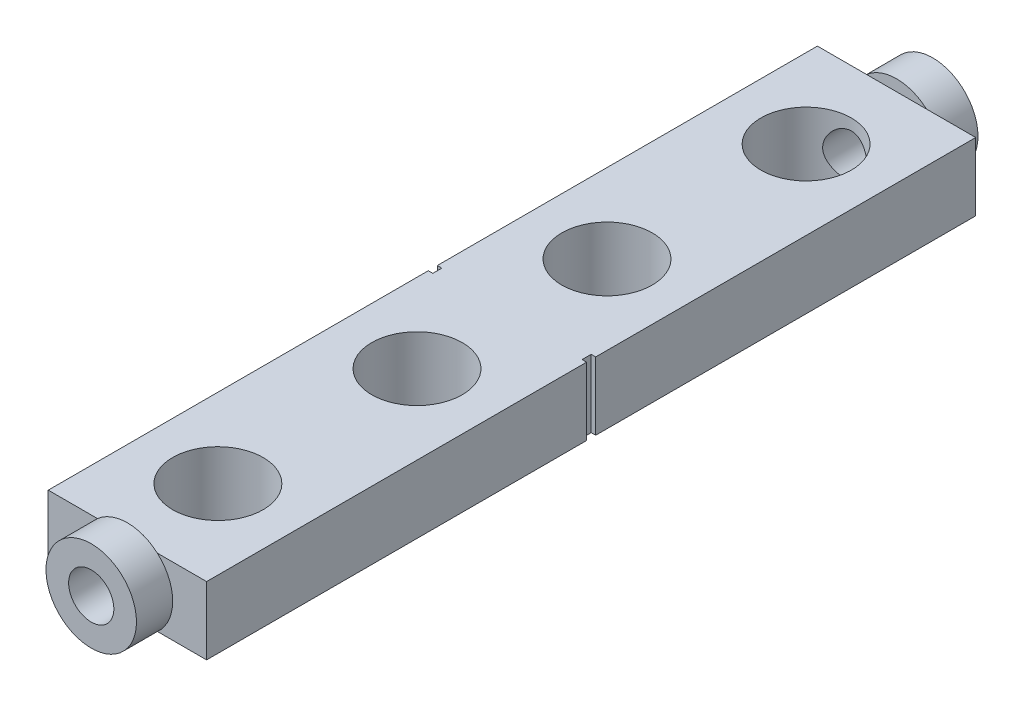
ISO-10303-21;
HEADER;
FILE_DESCRIPTION(('STEP AP214'),'2;1');
FILE_NAME('part.step','',(''),(''),'','','');
FILE_SCHEMA(('AUTOMOTIVE_DESIGN { 1 0 10303 214 1 1 1 1 }'));
ENDSEC;
DATA;
#1=APPLICATION_CONTEXT('core data for automotive mechanical design processes');
#2=APPLICATION_PROTOCOL_DEFINITION('international standard','automotive_design',2000,#1);
#3=PRODUCT_CONTEXT('',#1,'mechanical');
#4=PRODUCT('Part','Part','',(#3));
#5=PRODUCT_RELATED_PRODUCT_CATEGORY('part','',(#4));
#6=PRODUCT_DEFINITION_FORMATION('','',#4);
#7=PRODUCT_DEFINITION_CONTEXT('part definition',#1,'design');
#8=PRODUCT_DEFINITION('design','',#6,#7);
#9=PRODUCT_DEFINITION_SHAPE('','',#8);
#10=(LENGTH_UNIT() NAMED_UNIT(*) SI_UNIT(.MILLI.,.METRE.));
#11=(NAMED_UNIT(*) PLANE_ANGLE_UNIT() SI_UNIT($,.RADIAN.));
#12=(NAMED_UNIT(*) SI_UNIT($,.STERADIAN.) SOLID_ANGLE_UNIT());
#13=UNCERTAINTY_MEASURE_WITH_UNIT(LENGTH_MEASURE(1.E-05),#10,'distance_accuracy_value','');
#14=(GEOMETRIC_REPRESENTATION_CONTEXT(3) GLOBAL_UNCERTAINTY_ASSIGNED_CONTEXT((#13)) GLOBAL_UNIT_ASSIGNED_CONTEXT((#10,
#11,#12)) REPRESENTATION_CONTEXT('',''));
#15=CARTESIAN_POINT('',(0.,0.,0.));
#16=DIRECTION('',(0.,0.,1.));
#17=DIRECTION('',(1.,0.,0.));
#18=AXIS2_PLACEMENT_3D('',#15,#16,#17);
#19=CARTESIAN_POINT('',(1.75,0.75,8.50000000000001));
#20=DIRECTION('',(0.,0.,-1.));
#21=DIRECTION('',(-1.,0.,0.));
#22=AXIS2_PLACEMENT_3D('',#19,#20,#21);
#23=PLANE('',#22);
#24=CARTESIAN_POINT('',(0.,0.,8.50000000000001));
#25=DIRECTION('',(0.,0.,1.));
#26=DIRECTION('',(1.,0.,0.));
#27=AXIS2_PLACEMENT_3D('',#24,#25,#26);
#28=CIRCLE('',#27,1.);
#29=CARTESIAN_POINT('',(-0.661437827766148,0.75,8.50000000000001));
#30=VERTEX_POINT('',#29);
#31=CARTESIAN_POINT('',(-0.661437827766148,-0.75,8.50000000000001));
#32=VERTEX_POINT('',#31);
#33=EDGE_CURVE('E11',#30,#32,#28,.T.);
#34=ORIENTED_EDGE('',*,*,#33,.F.);
#35=DIRECTION('',(1.,0.,0.));
#36=VECTOR('',#35,1.);
#37=CARTESIAN_POINT('',(1.75,0.75,8.50000000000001));
#38=LINE('',#37,#36);
#39=CARTESIAN_POINT('',(-1.75,0.75,8.50000000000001));
#40=VERTEX_POINT('',#39);
#41=EDGE_CURVE('E347',#40,#30,#38,.T.);
#42=ORIENTED_EDGE('',*,*,#41,.F.);
#43=DIRECTION('',(0.,-1.,0.));
#44=VECTOR('',#43,1.);
#45=CARTESIAN_POINT('',(-1.75,0.75,8.50000000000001));
#46=LINE('',#45,#44);
#47=CARTESIAN_POINT('',(-1.75,-0.75,8.50000000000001));
#48=VERTEX_POINT('',#47);
#49=EDGE_CURVE('E319',#40,#48,#46,.T.);
#50=ORIENTED_EDGE('',*,*,#49,.T.);
#51=DIRECTION('',(1.,0.,0.));
#52=VECTOR('',#51,1.);
#53=CARTESIAN_POINT('',(1.75,-0.75,8.50000000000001));
#54=LINE('',#53,#52);
#55=EDGE_CURVE('E322',#48,#32,#54,.T.);
#56=ORIENTED_EDGE('',*,*,#55,.T.);
#57=EDGE_LOOP('',(#34,#42,#50,#56));
#58=FACE_BOUND('',#57,.T.);
#59=ADVANCED_FACE('F31',(#58),#23,.F.);
#60=CARTESIAN_POINT('',(0.661437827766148,-0.75,8.50000000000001));
#61=VERTEX_POINT('',#60);
#62=CARTESIAN_POINT('',(0.661437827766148,0.75,8.50000000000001));
#63=VERTEX_POINT('',#62);
#64=EDGE_CURVE('E40',#61,#63,#28,.T.);
#65=ORIENTED_EDGE('',*,*,#64,.F.);
#66=CARTESIAN_POINT('',(1.75,-0.75,8.50000000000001));
#67=VERTEX_POINT('',#66);
#68=EDGE_CURVE('E323',#61,#67,#54,.T.);
#69=ORIENTED_EDGE('',*,*,#68,.T.);
#70=DIRECTION('',(0.,-1.,0.));
#71=VECTOR('',#70,1.);
#72=CARTESIAN_POINT('',(1.75,0.75,8.50000000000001));
#73=LINE('',#72,#71);
#74=CARTESIAN_POINT('',(1.75,0.75,8.50000000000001));
#75=VERTEX_POINT('',#74);
#76=EDGE_CURVE('E343',#75,#67,#73,.T.);
#77=ORIENTED_EDGE('',*,*,#76,.F.);
#78=EDGE_CURVE('E352',#63,#75,#38,.T.);
#79=ORIENTED_EDGE('',*,*,#78,.F.);
#80=EDGE_LOOP('',(#65,#69,#77,#79));
#81=FACE_BOUND('',#80,.T.);
#82=ADVANCED_FACE('F275',(#81),#23,.F.);
#83=CARTESIAN_POINT('',(-1.65,0.75,0.));
#84=DIRECTION('',(0.,-1.,0.));
#85=DIRECTION('',(0.,0.,-1.));
#86=AXIS2_PLACEMENT_3D('',#83,#84,#85);
#87=PLANE('',#86);
#88=CARTESIAN_POINT('',(0.,0.75,6.5));
#89=DIRECTION('',(0.,1.,0.));
#90=DIRECTION('',(0.,0.,1.));
#91=AXIS2_PLACEMENT_3D('',#88,#89,#90);
#92=CIRCLE('',#91,1.);
#93=CARTESIAN_POINT('',(0.,0.75,7.5));
#94=VERTEX_POINT('',#93);
#95=EDGE_CURVE('E364',#94,#94,#92,.T.);
#96=ORIENTED_EDGE('',*,*,#95,.F.);
#97=EDGE_LOOP('',(#96));
#98=FACE_BOUND('',#97,.T.);
#99=DIRECTION('',(0.,0.,1.));
#100=VECTOR('',#99,1.);
#101=CARTESIAN_POINT('',(-1.65,0.75,0.1));
#102=LINE('',#101,#100);
#103=CARTESIAN_POINT('',(-1.65,0.75,-0.0999999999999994));
#104=VERTEX_POINT('',#103);
#105=CARTESIAN_POINT('',(-1.65,0.75,0.1));
#106=VERTEX_POINT('',#105);
#107=EDGE_CURVE('E335',#104,#106,#102,.T.);
#108=ORIENTED_EDGE('',*,*,#107,.T.);
#109=DIRECTION('',(-1.,0.,0.));
#110=VECTOR('',#109,1.);
#111=CARTESIAN_POINT('',(-1.75,0.75,0.0999999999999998));
#112=LINE('',#111,#110);
#113=CARTESIAN_POINT('',(-1.75,0.75,0.0999999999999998));
#114=VERTEX_POINT('',#113);
#115=EDGE_CURVE('E357',#106,#114,#112,.T.);
#116=ORIENTED_EDGE('',*,*,#115,.T.);
#117=DIRECTION('',(0.,0.,1.));
#118=VECTOR('',#117,1.);
#119=CARTESIAN_POINT('',(-1.75,0.75,8.50000000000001));
#120=LINE('',#119,#118);
#121=EDGE_CURVE('E318',#114,#40,#120,.T.);
#122=ORIENTED_EDGE('',*,*,#121,.T.);
#123=ORIENTED_EDGE('',*,*,#41,.T.);
#124=EDGE_CURVE('E350',#30,#63,#38,.T.);
#125=ORIENTED_EDGE('',*,*,#124,.T.);
#126=ORIENTED_EDGE('',*,*,#78,.T.);
#127=DIRECTION('',(0.,0.,-1.));
#128=VECTOR('',#127,1.);
#129=CARTESIAN_POINT('',(1.75,0.75,0.0999999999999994));
#130=LINE('',#129,#128);
#131=CARTESIAN_POINT('',(1.75,0.75,0.0999999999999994));
#132=VERTEX_POINT('',#131);
#133=EDGE_CURVE('E349',#75,#132,#130,.T.);
#134=ORIENTED_EDGE('',*,*,#133,.T.);
#135=DIRECTION('',(-1.,0.,0.));
#136=VECTOR('',#135,1.);
#137=CARTESIAN_POINT('',(1.65,0.75,0.0999999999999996));
#138=LINE('',#137,#136);
#139=CARTESIAN_POINT('',(1.65,0.75,0.0999999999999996));
#140=VERTEX_POINT('',#139);
#141=EDGE_CURVE('E353',#132,#140,#138,.T.);
#142=ORIENTED_EDGE('',*,*,#141,.T.);
#143=DIRECTION('',(0.,0.,-1.));
#144=VECTOR('',#143,1.);
#145=CARTESIAN_POINT('',(1.65,0.75,0.));
#146=LINE('',#145,#144);
#147=CARTESIAN_POINT('',(1.65,0.75,-0.1));
#148=VERTEX_POINT('',#147);
#149=EDGE_CURVE('E340',#140,#148,#146,.T.);
#150=ORIENTED_EDGE('',*,*,#149,.T.);
#151=DIRECTION('',(-1.,0.,0.));
#152=VECTOR('',#151,1.);
#153=CARTESIAN_POINT('',(1.65,0.75,-0.1));
#154=LINE('',#153,#152);
#155=CARTESIAN_POINT('',(1.75,0.75,-0.1));
#156=VERTEX_POINT('',#155);
#157=EDGE_CURVE('E210',#156,#148,#154,.T.);
#158=ORIENTED_EDGE('',*,*,#157,.F.);
#159=DIRECTION('',(0.,0.,1.));
#160=VECTOR('',#159,1.);
#161=CARTESIAN_POINT('',(1.75,0.75,-0.1));
#162=LINE('',#161,#160);
#163=CARTESIAN_POINT('',(1.75,0.75,-8.50000000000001));
#164=VERTEX_POINT('',#163);
#165=EDGE_CURVE('E174',#164,#156,#162,.T.);
#166=ORIENTED_EDGE('',*,*,#165,.F.);
#167=DIRECTION('',(1.,0.,0.));
#168=VECTOR('',#167,1.);
#169=CARTESIAN_POINT('',(1.75,0.75,-8.50000000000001));
#170=LINE('',#169,#168);
#171=CARTESIAN_POINT('',(0.661437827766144,0.75,-8.50000000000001));
#172=VERTEX_POINT('',#171);
#173=EDGE_CURVE('E166',#172,#164,#170,.T.);
#174=ORIENTED_EDGE('',*,*,#173,.F.);
#175=CARTESIAN_POINT('',(-0.661437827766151,0.75,-8.50000000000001));
#176=VERTEX_POINT('',#175);
#177=EDGE_CURVE('E159',#176,#172,#170,.T.);
#178=ORIENTED_EDGE('',*,*,#177,.F.);
#179=CARTESIAN_POINT('',(-1.75,0.75,-8.50000000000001));
#180=VERTEX_POINT('',#179);
#181=EDGE_CURVE('E165',#180,#176,#170,.T.);
#182=ORIENTED_EDGE('',*,*,#181,.F.);
#183=DIRECTION('',(0.,0.,-1.));
#184=VECTOR('',#183,1.);
#185=CARTESIAN_POINT('',(-1.75,0.75,-8.50000000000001));
#186=LINE('',#185,#184);
#187=CARTESIAN_POINT('',(-1.75,0.75,-0.0999999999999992));
#188=VERTEX_POINT('',#187);
#189=EDGE_CURVE('E178',#188,#180,#186,.T.);
#190=ORIENTED_EDGE('',*,*,#189,.F.);
#191=DIRECTION('',(-1.,0.,0.));
#192=VECTOR('',#191,1.);
#193=CARTESIAN_POINT('',(-1.75,0.75,-0.0999999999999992));
#194=LINE('',#193,#192);
#195=EDGE_CURVE('E204',#104,#188,#194,.T.);
#196=ORIENTED_EDGE('',*,*,#195,.F.);
#197=EDGE_LOOP('',(#108,#116,#122,#123,#125,#126,#134,#142,#150,#158,#166,#174,#178,#182,#190,#196));
#198=FACE_BOUND('',#197,.T.);
#199=CARTESIAN_POINT('',(0.,0.75,2.1));
#200=DIRECTION('',(0.,1.,0.));
#201=DIRECTION('',(0.,0.,-1.));
#202=AXIS2_PLACEMENT_3D('',#199,#200,#201);
#203=CIRCLE('',#202,1.);
#204=CARTESIAN_POINT('',(0.,0.75,1.1));
#205=VERTEX_POINT('',#204);
#206=EDGE_CURVE('E365',#205,#205,#203,.T.);
#207=ORIENTED_EDGE('',*,*,#206,.F.);
#208=EDGE_LOOP('',(#207));
#209=FACE_BOUND('',#208,.T.);
#210=CARTESIAN_POINT('',(0.,0.75,-6.5));
#211=DIRECTION('',(0.,-1.,0.));
#212=DIRECTION('',(0.,0.,-1.));
#213=AXIS2_PLACEMENT_3D('',#210,#211,#212);
#214=CIRCLE('',#213,1.);
#215=CARTESIAN_POINT('',(0.,0.75,-7.5));
#216=VERTEX_POINT('',#215);
#217=EDGE_CURVE('E198',#216,#216,#214,.T.);
#218=ORIENTED_EDGE('',*,*,#217,.T.);
#219=EDGE_LOOP('',(#218));
#220=FACE_BOUND('',#219,.T.);
#221=CARTESIAN_POINT('',(0.,0.75,-2.1));
#222=DIRECTION('',(0.,-1.,0.));
#223=DIRECTION('',(0.,0.,1.));
#224=AXIS2_PLACEMENT_3D('',#221,#222,#223);
#225=CIRCLE('',#224,1.);
#226=CARTESIAN_POINT('',(0.,0.75,-1.1));
#227=VERTEX_POINT('',#226);
#228=EDGE_CURVE('E191',#227,#227,#225,.T.);
#229=ORIENTED_EDGE('',*,*,#228,.T.);
#230=EDGE_LOOP('',(#229));
#231=FACE_BOUND('',#230,.T.);
#232=ADVANCED_FACE('F170',(#98,#198,#209,#220,#231),#87,.F.);
#233=CARTESIAN_POINT('',(-1.65,-0.75,0.));
#234=DIRECTION('',(0.,-1.,0.));
#235=DIRECTION('',(0.,0.,-1.));
#236=AXIS2_PLACEMENT_3D('',#233,#234,#235);
#237=PLANE('',#236);
#238=CARTESIAN_POINT('',(0.,-0.75,6.5));
#239=DIRECTION('',(0.,1.,0.));
#240=DIRECTION('',(0.,0.,1.));
#241=AXIS2_PLACEMENT_3D('',#238,#239,#240);
#242=CIRCLE('',#241,1.);
#243=CARTESIAN_POINT('',(0.,-0.75,7.5));
#244=VERTEX_POINT('',#243);
#245=EDGE_CURVE('E361',#244,#244,#242,.T.);
#246=ORIENTED_EDGE('',*,*,#245,.T.);
#247=EDGE_LOOP('',(#246));
#248=FACE_BOUND('',#247,.T.);
#249=DIRECTION('',(0.,0.,1.));
#250=VECTOR('',#249,1.);
#251=CARTESIAN_POINT('',(-1.65,-0.75,0.1));
#252=LINE('',#251,#250);
#253=CARTESIAN_POINT('',(-1.65,-0.75,-0.0999999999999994));
#254=VERTEX_POINT('',#253);
#255=CARTESIAN_POINT('',(-1.65,-0.75,0.1));
#256=VERTEX_POINT('',#255);
#257=EDGE_CURVE('E314',#254,#256,#252,.T.);
#258=ORIENTED_EDGE('',*,*,#257,.F.);
#259=DIRECTION('',(-1.,0.,0.));
#260=VECTOR('',#259,1.);
#261=CARTESIAN_POINT('',(-1.75,-0.75,-0.0999999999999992));
#262=LINE('',#261,#260);
#263=CARTESIAN_POINT('',(-1.75,-0.75,-0.0999999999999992));
#264=VERTEX_POINT('',#263);
#265=EDGE_CURVE('E201',#254,#264,#262,.T.);
#266=ORIENTED_EDGE('',*,*,#265,.T.);
#267=DIRECTION('',(0.,0.,-1.));
#268=VECTOR('',#267,1.);
#269=CARTESIAN_POINT('',(-1.75,-0.75,-8.50000000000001));
#270=LINE('',#269,#268);
#271=CARTESIAN_POINT('',(-1.75,-0.75,-8.50000000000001));
#272=VERTEX_POINT('',#271);
#273=EDGE_CURVE('E216',#264,#272,#270,.T.);
#274=ORIENTED_EDGE('',*,*,#273,.T.);
#275=DIRECTION('',(1.,0.,0.));
#276=VECTOR('',#275,1.);
#277=CARTESIAN_POINT('',(1.75,-0.75,-8.50000000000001));
#278=LINE('',#277,#276);
#279=CARTESIAN_POINT('',(-0.661437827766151,-0.75,-8.50000000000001));
#280=VERTEX_POINT('',#279);
#281=EDGE_CURVE('E218',#272,#280,#278,.T.);
#282=ORIENTED_EDGE('',*,*,#281,.T.);
#283=CARTESIAN_POINT('',(0.661437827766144,-0.75,-8.50000000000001));
#284=VERTEX_POINT('',#283);
#285=EDGE_CURVE('E222',#280,#284,#278,.T.);
#286=ORIENTED_EDGE('',*,*,#285,.T.);
#287=CARTESIAN_POINT('',(1.75,-0.75,-8.50000000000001));
#288=VERTEX_POINT('',#287);
#289=EDGE_CURVE('E182',#284,#288,#278,.T.);
#290=ORIENTED_EDGE('',*,*,#289,.T.);
#291=DIRECTION('',(0.,0.,1.));
#292=VECTOR('',#291,1.);
#293=CARTESIAN_POINT('',(1.75,-0.75,-0.1));
#294=LINE('',#293,#292);
#295=CARTESIAN_POINT('',(1.75,-0.75,-0.1));
#296=VERTEX_POINT('',#295);
#297=EDGE_CURVE('E221',#288,#296,#294,.T.);
#298=ORIENTED_EDGE('',*,*,#297,.T.);
#299=DIRECTION('',(-1.,0.,0.));
#300=VECTOR('',#299,1.);
#301=CARTESIAN_POINT('',(1.65,-0.75,-0.1));
#302=LINE('',#301,#300);
#303=CARTESIAN_POINT('',(1.65,-0.75,-0.1));
#304=VERTEX_POINT('',#303);
#305=EDGE_CURVE('E207',#296,#304,#302,.T.);
#306=ORIENTED_EDGE('',*,*,#305,.T.);
#307=DIRECTION('',(0.,0.,-1.));
#308=VECTOR('',#307,1.);
#309=CARTESIAN_POINT('',(1.65,-0.75,0.));
#310=LINE('',#309,#308);
#311=CARTESIAN_POINT('',(1.65,-0.75,0.0999999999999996));
#312=VERTEX_POINT('',#311);
#313=EDGE_CURVE('E333',#312,#304,#310,.T.);
#314=ORIENTED_EDGE('',*,*,#313,.F.);
#315=DIRECTION('',(-1.,0.,0.));
#316=VECTOR('',#315,1.);
#317=CARTESIAN_POINT('',(1.65,-0.75,0.0999999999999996));
#318=LINE('',#317,#316);
#319=CARTESIAN_POINT('',(1.75,-0.75,0.0999999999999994));
#320=VERTEX_POINT('',#319);
#321=EDGE_CURVE('E331',#320,#312,#318,.T.);
#322=ORIENTED_EDGE('',*,*,#321,.F.);
#323=DIRECTION('',(0.,0.,-1.));
#324=VECTOR('',#323,1.);
#325=CARTESIAN_POINT('',(1.75,-0.75,0.0999999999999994));
#326=LINE('',#325,#324);
#327=EDGE_CURVE('E329',#67,#320,#326,.T.);
#328=ORIENTED_EDGE('',*,*,#327,.F.);
#329=ORIENTED_EDGE('',*,*,#68,.F.);
#330=EDGE_CURVE('E325',#32,#61,#54,.T.);
#331=ORIENTED_EDGE('',*,*,#330,.F.);
#332=ORIENTED_EDGE('',*,*,#55,.F.);
#333=DIRECTION('',(0.,0.,1.));
#334=VECTOR('',#333,1.);
#335=CARTESIAN_POINT('',(-1.75,-0.75,8.50000000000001));
#336=LINE('',#335,#334);
#337=CARTESIAN_POINT('',(-1.75,-0.75,0.0999999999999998));
#338=VERTEX_POINT('',#337);
#339=EDGE_CURVE('E313',#338,#48,#336,.T.);
#340=ORIENTED_EDGE('',*,*,#339,.F.);
#341=DIRECTION('',(-1.,0.,0.));
#342=VECTOR('',#341,1.);
#343=CARTESIAN_POINT('',(-1.75,-0.75,0.0999999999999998));
#344=LINE('',#343,#342);
#345=EDGE_CURVE('E305',#256,#338,#344,.T.);
#346=ORIENTED_EDGE('',*,*,#345,.F.);
#347=EDGE_LOOP('',(#258,#266,#274,#282,#286,#290,#298,#306,#314,#322,#328,#329,#331,#332,#340,#346));
#348=FACE_BOUND('',#347,.T.);
#349=CARTESIAN_POINT('',(0.,-0.75,2.1));
#350=DIRECTION('',(0.,1.,0.));
#351=DIRECTION('',(0.,0.,-1.));
#352=AXIS2_PLACEMENT_3D('',#349,#350,#351);
#353=CIRCLE('',#352,1.);
#354=CARTESIAN_POINT('',(0.,-0.75,1.1));
#355=VERTEX_POINT('',#354);
#356=EDGE_CURVE('E368',#355,#355,#353,.T.);
#357=ORIENTED_EDGE('',*,*,#356,.T.);
#358=EDGE_LOOP('',(#357));
#359=FACE_BOUND('',#358,.T.);
#360=CARTESIAN_POINT('',(0.,-0.75,-6.5));
#361=DIRECTION('',(0.,-1.,0.));
#362=DIRECTION('',(0.,0.,-1.));
#363=AXIS2_PLACEMENT_3D('',#360,#361,#362);
#364=CIRCLE('',#363,1.);
#365=CARTESIAN_POINT('',(0.,-0.75,-7.5));
#366=VERTEX_POINT('',#365);
#367=EDGE_CURVE('E194',#366,#366,#364,.T.);
#368=ORIENTED_EDGE('',*,*,#367,.F.);
#369=EDGE_LOOP('',(#368));
#370=FACE_BOUND('',#369,.T.);
#371=CARTESIAN_POINT('',(0.,-0.75,-2.1));
#372=DIRECTION('',(0.,-1.,0.));
#373=DIRECTION('',(0.,0.,1.));
#374=AXIS2_PLACEMENT_3D('',#371,#372,#373);
#375=CIRCLE('',#374,1.);
#376=CARTESIAN_POINT('',(0.,-0.75,-1.1));
#377=VERTEX_POINT('',#376);
#378=EDGE_CURVE('E195',#377,#377,#375,.T.);
#379=ORIENTED_EDGE('',*,*,#378,.F.);
#380=EDGE_LOOP('',(#379));
#381=FACE_BOUND('',#380,.T.);
#382=ADVANCED_FACE('F274',(#248,#348,#359,#370,#381),#237,.T.);
#383=CARTESIAN_POINT('',(-1.65,0.75,0.1));
#384=DIRECTION('',(1.,0.,0.));
#385=DIRECTION('',(0.,0.,-1.));
#386=AXIS2_PLACEMENT_3D('',#383,#384,#385);
#387=PLANE('',#386);
#388=ORIENTED_EDGE('',*,*,#257,.T.);
#389=DIRECTION('',(0.,-1.,0.));
#390=VECTOR('',#389,1.);
#391=CARTESIAN_POINT('',(-1.65,0.75,0.1));
#392=LINE('',#391,#390);
#393=EDGE_CURVE('E35',#106,#256,#392,.T.);
#394=ORIENTED_EDGE('',*,*,#393,.F.);
#395=ORIENTED_EDGE('',*,*,#107,.F.);
#396=DIRECTION('',(0.,-1.,0.));
#397=VECTOR('',#396,1.);
#398=CARTESIAN_POINT('',(-1.65,0.75,-0.0999999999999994));
#399=LINE('',#398,#397);
#400=EDGE_CURVE('E183',#104,#254,#399,.T.);
#401=ORIENTED_EDGE('',*,*,#400,.T.);
#402=EDGE_LOOP('',(#388,#394,#395,#401));
#403=FACE_BOUND('',#402,.T.);
#404=ADVANCED_FACE('F33',(#403),#387,.F.);
#405=CARTESIAN_POINT('',(-1.75,0.75,0.0999999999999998));
#406=DIRECTION('',(0.,0.,1.));
#407=DIRECTION('',(1.,0.,0.));
#408=AXIS2_PLACEMENT_3D('',#405,#406,#407);
#409=PLANE('',#408);
#410=ORIENTED_EDGE('',*,*,#345,.T.);
#411=DIRECTION('',(0.,-1.,0.));
#412=VECTOR('',#411,1.);
#413=CARTESIAN_POINT('',(-1.75,0.75,0.0999999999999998));
#414=LINE('',#413,#412);
#415=EDGE_CURVE('E307',#114,#338,#414,.T.);
#416=ORIENTED_EDGE('',*,*,#415,.F.);
#417=ORIENTED_EDGE('',*,*,#115,.F.);
#418=ORIENTED_EDGE('',*,*,#393,.T.);
#419=EDGE_LOOP('',(#410,#416,#417,#418));
#420=FACE_BOUND('',#419,.T.);
#421=ADVANCED_FACE('F295',(#420),#409,.F.);
#422=CARTESIAN_POINT('',(-1.75,0.75,8.50000000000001));
#423=DIRECTION('',(1.,0.,0.));
#424=DIRECTION('',(0.,0.,-1.));
#425=AXIS2_PLACEMENT_3D('',#422,#423,#424);
#426=PLANE('',#425);
#427=ORIENTED_EDGE('',*,*,#339,.T.);
#428=ORIENTED_EDGE('',*,*,#49,.F.);
#429=ORIENTED_EDGE('',*,*,#121,.F.);
#430=ORIENTED_EDGE('',*,*,#415,.T.);
#431=EDGE_LOOP('',(#427,#428,#429,#430));
#432=FACE_BOUND('',#431,.T.);
#433=ADVANCED_FACE('F290',(#432),#426,.F.);
#434=CARTESIAN_POINT('',(1.75,0.75,0.0999999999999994));
#435=DIRECTION('',(-1.,0.,0.));
#436=DIRECTION('',(0.,0.,1.));
#437=AXIS2_PLACEMENT_3D('',#434,#435,#436);
#438=PLANE('',#437);
#439=ORIENTED_EDGE('',*,*,#327,.T.);
#440=DIRECTION('',(0.,-1.,0.));
#441=VECTOR('',#440,1.);
#442=CARTESIAN_POINT('',(1.75,0.75,0.0999999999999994));
#443=LINE('',#442,#441);
#444=EDGE_CURVE('E339',#132,#320,#443,.T.);
#445=ORIENTED_EDGE('',*,*,#444,.F.);
#446=ORIENTED_EDGE('',*,*,#133,.F.);
#447=ORIENTED_EDGE('',*,*,#76,.T.);
#448=EDGE_LOOP('',(#439,#445,#446,#447));
#449=FACE_BOUND('',#448,.T.);
#450=ADVANCED_FACE('F286',(#449),#438,.F.);
#451=CARTESIAN_POINT('',(1.65,0.75,0.0999999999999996));
#452=DIRECTION('',(0.,0.,1.));
#453=DIRECTION('',(1.,0.,0.));
#454=AXIS2_PLACEMENT_3D('',#451,#452,#453);
#455=PLANE('',#454);
#456=ORIENTED_EDGE('',*,*,#321,.T.);
#457=DIRECTION('',(0.,-1.,0.));
#458=VECTOR('',#457,1.);
#459=CARTESIAN_POINT('',(1.65,0.75,0.0999999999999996));
#460=LINE('',#459,#458);
#461=EDGE_CURVE('E336',#140,#312,#460,.T.);
#462=ORIENTED_EDGE('',*,*,#461,.F.);
#463=ORIENTED_EDGE('',*,*,#141,.F.);
#464=ORIENTED_EDGE('',*,*,#444,.T.);
#465=EDGE_LOOP('',(#456,#462,#463,#464));
#466=FACE_BOUND('',#465,.T.);
#467=ADVANCED_FACE('F282',(#466),#455,.F.);
#468=CARTESIAN_POINT('',(1.65,0.75,0.));
#469=DIRECTION('',(-1.,0.,0.));
#470=DIRECTION('',(0.,0.,1.));
#471=AXIS2_PLACEMENT_3D('',#468,#469,#470);
#472=PLANE('',#471);
#473=ORIENTED_EDGE('',*,*,#313,.T.);
#474=DIRECTION('',(0.,-1.,0.));
#475=VECTOR('',#474,1.);
#476=CARTESIAN_POINT('',(1.65,0.75,-0.1));
#477=LINE('',#476,#475);
#478=EDGE_CURVE('E213',#148,#304,#477,.T.);
#479=ORIENTED_EDGE('',*,*,#478,.F.);
#480=ORIENTED_EDGE('',*,*,#149,.F.);
#481=ORIENTED_EDGE('',*,*,#461,.T.);
#482=EDGE_LOOP('',(#473,#479,#480,#481));
#483=FACE_BOUND('',#482,.T.);
#484=ADVANCED_FACE('F270',(#483),#472,.F.);
#485=CARTESIAN_POINT('',(0.,0.75,6.5));
#486=DIRECTION('',(0.,-1.,0.));
#487=DIRECTION('',(0.,0.,-1.));
#488=AXIS2_PLACEMENT_3D('',#485,#486,#487);
#489=CYLINDRICAL_SURFACE('',#488,1.);
#490=CARTESIAN_POINT('',(0.5,0.,7.36602540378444));
#491=CARTESIAN_POINT('',(0.499998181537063,0.0260539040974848,7.36602767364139));
#492=CARTESIAN_POINT('',(0.497949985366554,0.0521407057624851,7.36721900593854));
#493=CARTESIAN_POINT('',(0.489861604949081,0.103513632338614,7.37181183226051));
#494=CARTESIAN_POINT('',(0.483813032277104,0.128797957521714,7.37521797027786));
#495=CARTESIAN_POINT('',(0.468049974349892,0.177725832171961,7.38374673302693));
#496=CARTESIAN_POINT('',(0.458354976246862,0.201377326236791,7.38886021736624));
#497=CARTESIAN_POINT('',(0.43563376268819,0.246712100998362,7.40021332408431));
#498=CARTESIAN_POINT('',(0.422607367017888,0.268395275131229,7.40645300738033));
#499=CARTESIAN_POINT('',(0.392333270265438,0.311152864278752,7.4199843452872));
#500=CARTESIAN_POINT('',(0.374826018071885,0.332029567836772,7.42732031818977));
#501=CARTESIAN_POINT('',(0.336626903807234,0.370704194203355,7.44185991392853));
#502=CARTESIAN_POINT('',(0.315933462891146,0.388500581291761,7.44906346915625));
#503=CARTESIAN_POINT('',(0.270244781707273,0.421683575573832,7.46310738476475));
#504=CARTESIAN_POINT('',(0.245053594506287,0.436826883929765,7.46989053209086));
#505=CARTESIAN_POINT('',(0.192078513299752,0.462570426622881,7.48175378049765));
#506=CARTESIAN_POINT('',(0.164296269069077,0.473173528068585,7.48683495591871));
#507=CARTESIAN_POINT('',(0.109022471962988,0.488752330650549,7.49440230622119));
#508=CARTESIAN_POINT('',(0.0816508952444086,0.494074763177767,7.49704740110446));
#509=CARTESIAN_POINT('',(0.026285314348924,0.500083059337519,7.50003791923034));
#510=CARTESIAN_POINT('',(-0.00170830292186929,0.500771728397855,7.50038473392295));
#511=CARTESIAN_POINT('',(-0.054916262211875,0.497626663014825,7.49881490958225));
#512=CARTESIAN_POINT('',(-0.0801605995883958,0.494180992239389,7.4970924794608));
#513=CARTESIAN_POINT('',(-0.129656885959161,0.483559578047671,7.49187122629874));
#514=CARTESIAN_POINT('',(-0.153908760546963,0.476383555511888,7.48837227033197));
#515=CARTESIAN_POINT('',(-0.201154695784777,0.458458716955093,7.47985791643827));
#516=CARTESIAN_POINT('',(-0.224126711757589,0.447661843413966,7.474822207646));
#517=CARTESIAN_POINT('',(-0.267988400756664,0.422868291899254,7.46368822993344));
#518=CARTESIAN_POINT('',(-0.288877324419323,0.408870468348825,7.45758958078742));
#519=CARTESIAN_POINT('',(-0.330086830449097,0.376552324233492,7.44422197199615));
#520=CARTESIAN_POINT('',(-0.35016703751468,0.357948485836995,7.43689687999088));
#521=CARTESIAN_POINT('',(-0.38705218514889,0.317705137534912,7.42227170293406));
#522=CARTESIAN_POINT('',(-0.403854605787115,0.296063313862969,7.41497164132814));
#523=CARTESIAN_POINT('',(-0.434752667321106,0.248675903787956,7.40072078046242));
#524=CARTESIAN_POINT('',(-0.448608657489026,0.222756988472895,7.39382159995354));
#525=CARTESIAN_POINT('',(-0.471659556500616,0.168531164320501,7.38187725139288));
#526=CARTESIAN_POINT('',(-0.480859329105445,0.140226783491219,7.37683015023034));
#527=CARTESIAN_POINT('',(-0.49359010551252,0.0843927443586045,7.36972317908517));
#528=CARTESIAN_POINT('',(-0.497512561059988,0.0569794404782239,7.36745827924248));
#529=CARTESIAN_POINT('',(-0.500758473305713,0.00179932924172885,7.36558959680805));
#530=CARTESIAN_POINT('',(-0.500085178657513,-0.0259672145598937,7.36598393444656));
#531=CARTESIAN_POINT('',(-0.494518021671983,-0.0778269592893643,7.36917168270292));
#532=CARTESIAN_POINT('',(-0.490093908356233,-0.101989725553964,7.37169793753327));
#533=CARTESIAN_POINT('',(-0.477848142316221,-0.149183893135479,7.3784701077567));
#534=CARTESIAN_POINT('',(-0.470025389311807,-0.172214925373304,7.38271658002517));
#535=CARTESIAN_POINT('',(-0.450823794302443,-0.217705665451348,7.39268111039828));
#536=CARTESIAN_POINT('',(-0.439297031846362,-0.240089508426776,7.39845821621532));
#537=CARTESIAN_POINT('',(-0.413143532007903,-0.282734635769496,7.41078059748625));
#538=CARTESIAN_POINT('',(-0.398515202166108,-0.302994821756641,7.41732626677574));
#539=CARTESIAN_POINT('',(-0.364418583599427,-0.343489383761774,7.43143999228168));
#540=CARTESIAN_POINT('',(-0.344572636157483,-0.363398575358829,7.43903291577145));
#541=CARTESIAN_POINT('',(-0.301702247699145,-0.399706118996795,7.45367117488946));
#542=CARTESIAN_POINT('',(-0.278676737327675,-0.416103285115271,7.46071632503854));
#543=CARTESIAN_POINT('',(-0.229267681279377,-0.44528686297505,7.47370680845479));
#544=CARTESIAN_POINT('',(-0.202811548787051,-0.457966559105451,7.47961820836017));
#545=CARTESIAN_POINT('',(-0.147761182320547,-0.4785689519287,7.48941677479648));
#546=CARTESIAN_POINT('',(-0.11916885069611,-0.486495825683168,7.49330571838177));
#547=CARTESIAN_POINT('',(-0.0634898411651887,-0.496684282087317,7.4983375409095));
#548=CARTESIAN_POINT('',(-0.0365057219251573,-0.499398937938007,7.49969963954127));
#549=CARTESIAN_POINT('',(0.0175629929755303,-0.50042163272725,7.50021065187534));
#550=CARTESIAN_POINT('',(0.0446475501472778,-0.498731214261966,7.49936034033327));
#551=CARTESIAN_POINT('',(0.0962689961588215,-0.491291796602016,7.49566984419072));
#552=CARTESIAN_POINT('',(0.120856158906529,-0.485817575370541,7.49296447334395));
#553=CARTESIAN_POINT('',(0.168722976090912,-0.471336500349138,7.48596046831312));
#554=CARTESIAN_POINT('',(0.192002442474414,-0.462329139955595,7.48166160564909));
#555=CARTESIAN_POINT('',(0.237711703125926,-0.440636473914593,7.47162965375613));
#556=CARTESIAN_POINT('',(0.260062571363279,-0.427810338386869,7.4658430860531));
#557=CARTESIAN_POINT('',(0.30238732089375,-0.39902103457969,7.45344066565));
#558=CARTESIAN_POINT('',(0.322360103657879,-0.383056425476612,7.44682443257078));
#559=CARTESIAN_POINT('',(0.361457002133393,-0.346601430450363,7.43264305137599));
#560=CARTESIAN_POINT('',(0.380298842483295,-0.325818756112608,7.42504899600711));
#561=CARTESIAN_POINT('',(0.414331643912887,-0.281274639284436,7.41031538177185));
#562=CARTESIAN_POINT('',(0.429519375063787,-0.257510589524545,7.40317622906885));
#563=CARTESIAN_POINT('',(0.456215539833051,-0.206681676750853,7.38999802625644));
#564=CARTESIAN_POINT('',(0.467592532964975,-0.179536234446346,7.38400087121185));
#565=CARTESIAN_POINT('',(0.485439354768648,-0.123333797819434,7.37433078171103));
#566=CARTESIAN_POINT('',(0.491925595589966,-0.0942835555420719,7.37065008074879));
#567=CARTESIAN_POINT('',(0.497183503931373,-0.0540973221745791,7.36764636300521));
#568=CARTESIAN_POINT('',(0.498238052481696,-0.0433160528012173,7.36704064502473));
#569=CARTESIAN_POINT('',(0.499646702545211,-0.0216917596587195,7.36622967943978));
#570=CARTESIAN_POINT('',(0.50000075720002,-0.0108487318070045,7.36602445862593));
#571=CARTESIAN_POINT('',(0.5,0.,7.36602540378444));
#572=B_SPLINE_CURVE_WITH_KNOTS('',3,(#490,#491,#492,#493,#494,#495,#496,#497,#498,#499,#500,
#501,#502,#503,#504,#505,#506,#507,#508,#509,#510,#511,#512,#513,#514,#515,#516,#517,#518,#519,
#520,#521,#522,#523,#524,#525,#526,#527,#528,#529,#530,#531,#532,#533,#534,#535,#536,#537,#538,
#539,#540,#541,#542,#543,#544,#545,#546,#547,#548,#549,#550,#551,#552,#553,#554,#555,#556,#557,
#558,#559,#560,#561,#562,#563,#564,#565,#566,#567,#568,#569,#570,#571),.UNSPECIFIED.,.T.,.F.,(4,
2,2,2,2,2,2,2,2,2,2,2,2,2,2,2,2,2,2,2,2,2,2,2,2,2,2,2,2,2,2,2,2,2,2,2,2,2,2,2,4),(0.,
0.0781160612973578,0.156396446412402,0.234264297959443,0.312136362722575,0.396431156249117,
0.480767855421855,0.570789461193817,0.660754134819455,0.744317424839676,0.8278301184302,
0.904080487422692,0.980336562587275,1.05764767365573,1.13498649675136,1.21963595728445,
1.30435024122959,1.39444420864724,1.48444387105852,1.56731145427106,1.65012046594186,
1.72387091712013,1.79764526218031,1.87483648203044,1.95206743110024,2.03903371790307,
2.12602932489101,2.21532090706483,2.30453389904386,2.38556135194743,2.46656043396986,
2.54222212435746,2.61789466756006,2.69680375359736,2.77574915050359,2.8625512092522,
2.94942971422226,3.03905374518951,3.12837566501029,3.16090067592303,3.19342786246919),.UNSPECIFIED.);
#573=CARTESIAN_POINT('',(0.5,0.,7.36602540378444));
#574=VERTEX_POINT('',#573);
#575=EDGE_CURVE('E184',#574,#574,#572,.T.);
#576=ORIENTED_EDGE('',*,*,#575,.T.);
#577=EDGE_LOOP('',(#576));
#578=FACE_BOUND('',#577,.T.);
#579=ORIENTED_EDGE('',*,*,#95,.T.);
#580=EDGE_LOOP('',(#579));
#581=FACE_BOUND('',#580,.T.);
#582=ORIENTED_EDGE('',*,*,#245,.F.);
#583=EDGE_LOOP('',(#582));
#584=FACE_BOUND('',#583,.T.);
#585=ADVANCED_FACE('F266',(#578,#581,#584),#489,.F.);
#586=CARTESIAN_POINT('',(0.,0.75,2.1));
#587=DIRECTION('',(0.,-1.,0.));
#588=DIRECTION('',(0.,0.,-1.));
#589=AXIS2_PLACEMENT_3D('',#586,#587,#588);
#590=CYLINDRICAL_SURFACE('',#589,1.);
#591=ORIENTED_EDGE('',*,*,#206,.T.);
#592=EDGE_LOOP('',(#591));
#593=FACE_BOUND('',#592,.T.);
#594=ORIENTED_EDGE('',*,*,#356,.F.);
#595=EDGE_LOOP('',(#594));
#596=FACE_BOUND('',#595,.T.);
#597=ADVANCED_FACE('F263',(#593,#596),#590,.F.);
#598=CARTESIAN_POINT('',(0.,0.,8.50000000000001));
#599=DIRECTION('',(0.,0.,1.));
#600=DIRECTION('',(1.,0.,0.));
#601=AXIS2_PLACEMENT_3D('',#598,#599,#600);
#602=PLANE('',#601);
#603=EDGE_CURVE('E42',#32,#61,#28,.T.);
#604=ORIENTED_EDGE('',*,*,#603,.F.);
#605=ORIENTED_EDGE('',*,*,#330,.T.);
#606=EDGE_LOOP('',(#604,#605));
#607=FACE_BOUND('',#606,.T.);
#608=ADVANCED_FACE('F259',(#607),#602,.F.);
#609=CARTESIAN_POINT('',(0.,0.,9.30000000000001));
#610=DIRECTION('',(0.,0.,-1.));
#611=DIRECTION('',(-1.,0.,0.));
#612=AXIS2_PLACEMENT_3D('',#609,#610,#611);
#613=CYLINDRICAL_SURFACE('',#612,1.);
#614=CARTESIAN_POINT('',(0.,0.,9.30000000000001));
#615=DIRECTION('',(0.,0.,1.));
#616=DIRECTION('',(1.,0.,0.));
#617=AXIS2_PLACEMENT_3D('',#614,#615,#616);
#618=CIRCLE('',#617,1.);
#619=CARTESIAN_POINT('',(1.,0.,9.30000000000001));
#620=VERTEX_POINT('',#619);
#621=EDGE_CURVE('E371',#620,#620,#618,.T.);
#622=ORIENTED_EDGE('',*,*,#621,.F.);
#623=EDGE_LOOP('',(#622));
#624=FACE_BOUND('',#623,.T.);
#625=EDGE_CURVE('E373',#63,#30,#28,.T.);
#626=ORIENTED_EDGE('',*,*,#625,.T.);
#627=ORIENTED_EDGE('',*,*,#33,.T.);
#628=ORIENTED_EDGE('',*,*,#603,.T.);
#629=ORIENTED_EDGE('',*,*,#64,.T.);
#630=EDGE_LOOP('',(#626,#627,#628,#629));
#631=FACE_BOUND('',#630,.T.);
#632=ADVANCED_FACE('F254',(#624,#631),#613,.T.);
#633=CARTESIAN_POINT('',(0.,0.,9.30000000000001));
#634=DIRECTION('',(0.,0.,1.));
#635=DIRECTION('',(1.,0.,0.));
#636=AXIS2_PLACEMENT_3D('',#633,#634,#635);
#637=PLANE('',#636);
#638=CARTESIAN_POINT('',(0.,0.,9.30000000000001));
#639=DIRECTION('',(0.,0.,1.));
#640=DIRECTION('',(1.,0.,0.));
#641=AXIS2_PLACEMENT_3D('',#638,#639,#640);
#642=CIRCLE('',#641,0.5);
#643=CARTESIAN_POINT('',(0.5,0.,9.30000000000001));
#644=VERTEX_POINT('',#643);
#645=EDGE_CURVE('E243',#644,#644,#642,.T.);
#646=ORIENTED_EDGE('',*,*,#645,.F.);
#647=EDGE_LOOP('',(#646));
#648=FACE_BOUND('',#647,.T.);
#649=ORIENTED_EDGE('',*,*,#621,.T.);
#650=EDGE_LOOP('',(#649));
#651=FACE_BOUND('',#650,.T.);
#652=ADVANCED_FACE('F250',(#648,#651),#637,.T.);
#653=ORIENTED_EDGE('',*,*,#124,.F.);
#654=ORIENTED_EDGE('',*,*,#625,.F.);
#655=EDGE_LOOP('',(#653,#654));
#656=FACE_BOUND('',#655,.T.);
#657=ADVANCED_FACE('F253',(#656),#602,.F.);
#658=CARTESIAN_POINT('',(0.,0.,-0.001000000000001));
#659=DIRECTION('',(0.,0.,1.));
#660=DIRECTION('',(1.,0.,0.));
#661=AXIS2_PLACEMENT_3D('',#658,#659,#660);
#662=CYLINDRICAL_SURFACE('',#661,0.5);
#663=ORIENTED_EDGE('',*,*,#575,.F.);
#664=EDGE_LOOP('',(#663));
#665=FACE_BOUND('',#664,.T.);
#666=ORIENTED_EDGE('',*,*,#645,.T.);
#667=EDGE_LOOP('',(#666));
#668=FACE_BOUND('',#667,.T.);
#669=ADVANCED_FACE('F245',(#665,#668),#662,.F.);
#670=CARTESIAN_POINT('',(1.75,0.75,-8.50000000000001));
#671=DIRECTION('',(0.,0.,1.));
#672=DIRECTION('',(-1.,0.,0.));
#673=AXIS2_PLACEMENT_3D('',#670,#671,#672);
#674=PLANE('',#673);
#675=CARTESIAN_POINT('',(0.,0.,-8.50000000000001));
#676=DIRECTION('',(0.,0.,1.));
#677=DIRECTION('',(1.,0.,0.));
#678=AXIS2_PLACEMENT_3D('',#675,#676,#677);
#679=CIRCLE('',#678,1.);
#680=EDGE_CURVE('E153',#176,#280,#679,.T.);
#681=ORIENTED_EDGE('',*,*,#680,.T.);
#682=ORIENTED_EDGE('',*,*,#281,.F.);
#683=DIRECTION('',(0.,-1.,0.));
#684=VECTOR('',#683,1.);
#685=CARTESIAN_POINT('',(-1.75,0.75,-8.50000000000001));
#686=LINE('',#685,#684);
#687=EDGE_CURVE('E233',#180,#272,#686,.T.);
#688=ORIENTED_EDGE('',*,*,#687,.F.);
#689=ORIENTED_EDGE('',*,*,#181,.T.);
#690=EDGE_LOOP('',(#681,#682,#688,#689));
#691=FACE_BOUND('',#690,.T.);
#692=ADVANCED_FACE('F404',(#691),#674,.F.);
#693=EDGE_CURVE('E151',#284,#172,#679,.T.);
#694=ORIENTED_EDGE('',*,*,#693,.T.);
#695=ORIENTED_EDGE('',*,*,#173,.T.);
#696=DIRECTION('',(0.,-1.,0.));
#697=VECTOR('',#696,1.);
#698=CARTESIAN_POINT('',(1.75,0.75,-8.50000000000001));
#699=LINE('',#698,#697);
#700=EDGE_CURVE('E231',#164,#288,#699,.T.);
#701=ORIENTED_EDGE('',*,*,#700,.T.);
#702=ORIENTED_EDGE('',*,*,#289,.F.);
#703=EDGE_LOOP('',(#694,#695,#701,#702));
#704=FACE_BOUND('',#703,.T.);
#705=ADVANCED_FACE('F180',(#704),#674,.F.);
#706=CARTESIAN_POINT('',(-1.75,0.75,-0.0999999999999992));
#707=DIRECTION('',(0.,0.,-1.));
#708=DIRECTION('',(1.,0.,0.));
#709=AXIS2_PLACEMENT_3D('',#706,#707,#708);
#710=PLANE('',#709);
#711=ORIENTED_EDGE('',*,*,#265,.F.);
#712=ORIENTED_EDGE('',*,*,#400,.F.);
#713=ORIENTED_EDGE('',*,*,#195,.T.);
#714=DIRECTION('',(0.,-1.,0.));
#715=VECTOR('',#714,1.);
#716=CARTESIAN_POINT('',(-1.75,0.75,-0.0999999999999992));
#717=LINE('',#716,#715);
#718=EDGE_CURVE('E186',#188,#264,#717,.T.);
#719=ORIENTED_EDGE('',*,*,#718,.T.);
#720=EDGE_LOOP('',(#711,#712,#713,#719));
#721=FACE_BOUND('',#720,.T.);
#722=ADVANCED_FACE('F396',(#721),#710,.F.);
#723=CARTESIAN_POINT('',(-1.75,0.75,-8.50000000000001));
#724=DIRECTION('',(1.,0.,0.));
#725=DIRECTION('',(0.,0.,1.));
#726=AXIS2_PLACEMENT_3D('',#723,#724,#725);
#727=PLANE('',#726);
#728=ORIENTED_EDGE('',*,*,#273,.F.);
#729=ORIENTED_EDGE('',*,*,#718,.F.);
#730=ORIENTED_EDGE('',*,*,#189,.T.);
#731=ORIENTED_EDGE('',*,*,#687,.T.);
#732=EDGE_LOOP('',(#728,#729,#730,#731));
#733=FACE_BOUND('',#732,.T.);
#734=ADVANCED_FACE('F400',(#733),#727,.F.);
#735=CARTESIAN_POINT('',(1.75,0.75,-0.1));
#736=DIRECTION('',(-1.,0.,0.));
#737=DIRECTION('',(0.,0.,-1.));
#738=AXIS2_PLACEMENT_3D('',#735,#736,#737);
#739=PLANE('',#738);
#740=ORIENTED_EDGE('',*,*,#297,.F.);
#741=ORIENTED_EDGE('',*,*,#700,.F.);
#742=ORIENTED_EDGE('',*,*,#165,.T.);
#743=DIRECTION('',(0.,-1.,0.));
#744=VECTOR('',#743,1.);
#745=CARTESIAN_POINT('',(1.75,0.75,-0.1));
#746=LINE('',#745,#744);
#747=EDGE_CURVE('E229',#156,#296,#746,.T.);
#748=ORIENTED_EDGE('',*,*,#747,.T.);
#749=EDGE_LOOP('',(#740,#741,#742,#748));
#750=FACE_BOUND('',#749,.T.);
#751=ADVANCED_FACE('F458',(#750),#739,.F.);
#752=CARTESIAN_POINT('',(1.65,0.75,-0.1));
#753=DIRECTION('',(0.,0.,-1.));
#754=DIRECTION('',(1.,0.,0.));
#755=AXIS2_PLACEMENT_3D('',#752,#753,#754);
#756=PLANE('',#755);
#757=ORIENTED_EDGE('',*,*,#305,.F.);
#758=ORIENTED_EDGE('',*,*,#747,.F.);
#759=ORIENTED_EDGE('',*,*,#157,.T.);
#760=ORIENTED_EDGE('',*,*,#478,.T.);
#761=EDGE_LOOP('',(#757,#758,#759,#760));
#762=FACE_BOUND('',#761,.T.);
#763=ADVANCED_FACE('F438',(#762),#756,.F.);
#764=CARTESIAN_POINT('',(0.,0.75,-6.5));
#765=DIRECTION('',(0.,-1.,0.));
#766=DIRECTION('',(0.,0.,1.));
#767=AXIS2_PLACEMENT_3D('',#764,#765,#766);
#768=CYLINDRICAL_SURFACE('',#767,1.);
#769=CARTESIAN_POINT('',(0.499999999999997,0.,-7.36602540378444));
#770=CARTESIAN_POINT('',(0.49999818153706,0.0260539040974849,-7.36602767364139));
#771=CARTESIAN_POINT('',(0.497949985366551,0.0521407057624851,-7.36721900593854));
#772=CARTESIAN_POINT('',(0.489861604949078,0.103513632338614,-7.37181183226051));
#773=CARTESIAN_POINT('',(0.483813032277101,0.128797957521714,-7.37521797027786));
#774=CARTESIAN_POINT('',(0.468049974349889,0.177725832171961,-7.38374673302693));
#775=CARTESIAN_POINT('',(0.458354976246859,0.201377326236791,-7.38886021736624));
#776=CARTESIAN_POINT('',(0.435633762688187,0.246712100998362,-7.40021332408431));
#777=CARTESIAN_POINT('',(0.422607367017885,0.268395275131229,-7.40645300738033));
#778=CARTESIAN_POINT('',(0.392333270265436,0.311152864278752,-7.4199843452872));
#779=CARTESIAN_POINT('',(0.374826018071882,0.332029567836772,-7.42732031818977));
#780=CARTESIAN_POINT('',(0.336626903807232,0.370704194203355,-7.44185991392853));
#781=CARTESIAN_POINT('',(0.315933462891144,0.388500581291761,-7.44906346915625));
#782=CARTESIAN_POINT('',(0.27024478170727,0.421683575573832,-7.46310738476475));
#783=CARTESIAN_POINT('',(0.245053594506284,0.436826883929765,-7.46989053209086));
#784=CARTESIAN_POINT('',(0.192078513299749,0.462570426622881,-7.48175378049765));
#785=CARTESIAN_POINT('',(0.164296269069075,0.473173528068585,-7.48683495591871));
#786=CARTESIAN_POINT('',(0.109022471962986,0.488752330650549,-7.49440230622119));
#787=CARTESIAN_POINT('',(0.0816508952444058,0.494074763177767,-7.49704740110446));
#788=CARTESIAN_POINT('',(0.0262853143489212,0.500083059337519,-7.50003791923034));
#789=CARTESIAN_POINT('',(-0.00170830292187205,0.500771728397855,-7.50038473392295));
#790=CARTESIAN_POINT('',(-0.0549162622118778,0.497626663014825,-7.49881490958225));
#791=CARTESIAN_POINT('',(-0.0801605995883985,0.494180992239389,-7.4970924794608));
#792=CARTESIAN_POINT('',(-0.129656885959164,0.483559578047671,-7.49187122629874));
#793=CARTESIAN_POINT('',(-0.153908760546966,0.476383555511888,-7.48837227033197));
#794=CARTESIAN_POINT('',(-0.20115469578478,0.458458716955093,-7.47985791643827));
#795=CARTESIAN_POINT('',(-0.224126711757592,0.447661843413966,-7.474822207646));
#796=CARTESIAN_POINT('',(-0.267988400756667,0.422868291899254,-7.46368822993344));
#797=CARTESIAN_POINT('',(-0.288877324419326,0.408870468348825,-7.45758958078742));
#798=CARTESIAN_POINT('',(-0.3300868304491,0.376552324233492,-7.44422197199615));
#799=CARTESIAN_POINT('',(-0.350167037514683,0.357948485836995,-7.43689687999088));
#800=CARTESIAN_POINT('',(-0.387052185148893,0.317705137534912,-7.42227170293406));
#801=CARTESIAN_POINT('',(-0.403854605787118,0.296063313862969,-7.41497164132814));
#802=CARTESIAN_POINT('',(-0.434752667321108,0.248675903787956,-7.40072078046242));
#803=CARTESIAN_POINT('',(-0.448608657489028,0.222756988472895,-7.39382159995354));
#804=CARTESIAN_POINT('',(-0.471659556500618,0.168531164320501,-7.38187725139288));
#805=CARTESIAN_POINT('',(-0.480859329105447,0.140226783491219,-7.37683015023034));
#806=CARTESIAN_POINT('',(-0.493590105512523,0.0843927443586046,-7.36972317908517));
#807=CARTESIAN_POINT('',(-0.497512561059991,0.0569794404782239,-7.36745827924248));
#808=CARTESIAN_POINT('',(-0.500758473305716,0.00179932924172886,-7.36558959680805));
#809=CARTESIAN_POINT('',(-0.500085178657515,-0.0259672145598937,-7.36598393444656));
#810=CARTESIAN_POINT('',(-0.494518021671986,-0.0778269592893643,-7.36917168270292));
#811=CARTESIAN_POINT('',(-0.490093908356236,-0.101989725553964,-7.37169793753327));
#812=CARTESIAN_POINT('',(-0.477848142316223,-0.149183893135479,-7.3784701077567));
#813=CARTESIAN_POINT('',(-0.47002538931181,-0.172214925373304,-7.38271658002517));
#814=CARTESIAN_POINT('',(-0.450823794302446,-0.217705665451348,-7.39268111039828));
#815=CARTESIAN_POINT('',(-0.439297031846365,-0.240089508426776,-7.39845821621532));
#816=CARTESIAN_POINT('',(-0.413143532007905,-0.282734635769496,-7.41078059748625));
#817=CARTESIAN_POINT('',(-0.398515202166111,-0.302994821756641,-7.41732626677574));
#818=CARTESIAN_POINT('',(-0.36441858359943,-0.343489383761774,-7.43143999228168));
#819=CARTESIAN_POINT('',(-0.344572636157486,-0.363398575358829,-7.43903291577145));
#820=CARTESIAN_POINT('',(-0.301702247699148,-0.399706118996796,-7.45367117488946));
#821=CARTESIAN_POINT('',(-0.278676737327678,-0.416103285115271,-7.46071632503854));
#822=CARTESIAN_POINT('',(-0.22926768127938,-0.44528686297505,-7.47370680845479));
#823=CARTESIAN_POINT('',(-0.202811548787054,-0.457966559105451,-7.47961820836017));
#824=CARTESIAN_POINT('',(-0.14776118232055,-0.4785689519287,-7.48941677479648));
#825=CARTESIAN_POINT('',(-0.119168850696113,-0.486495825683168,-7.49330571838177));
#826=CARTESIAN_POINT('',(-0.0634898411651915,-0.496684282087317,-7.4983375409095));
#827=CARTESIAN_POINT('',(-0.03650572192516,-0.499398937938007,-7.49969963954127));
#828=CARTESIAN_POINT('',(0.0175629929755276,-0.50042163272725,-7.50021065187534));
#829=CARTESIAN_POINT('',(0.0446475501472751,-0.498731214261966,-7.49936034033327));
#830=CARTESIAN_POINT('',(0.0962689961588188,-0.491291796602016,-7.49566984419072));
#831=CARTESIAN_POINT('',(0.120856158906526,-0.485817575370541,-7.49296447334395));
#832=CARTESIAN_POINT('',(0.168722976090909,-0.471336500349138,-7.48596046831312));
#833=CARTESIAN_POINT('',(0.192002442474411,-0.462329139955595,-7.48166160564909));
#834=CARTESIAN_POINT('',(0.237711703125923,-0.440636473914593,-7.47162965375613));
#835=CARTESIAN_POINT('',(0.260062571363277,-0.427810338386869,-7.4658430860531));
#836=CARTESIAN_POINT('',(0.302387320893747,-0.39902103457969,-7.45344066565));
#837=CARTESIAN_POINT('',(0.322360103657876,-0.383056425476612,-7.44682443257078));
#838=CARTESIAN_POINT('',(0.361457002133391,-0.346601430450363,-7.43264305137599));
#839=CARTESIAN_POINT('',(0.380298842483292,-0.325818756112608,-7.42504899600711));
#840=CARTESIAN_POINT('',(0.414331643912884,-0.281274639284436,-7.41031538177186));
#841=CARTESIAN_POINT('',(0.429519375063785,-0.257510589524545,-7.40317622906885));
#842=CARTESIAN_POINT('',(0.456215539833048,-0.206681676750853,-7.38999802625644));
#843=CARTESIAN_POINT('',(0.467592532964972,-0.179536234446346,-7.38400087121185));
#844=CARTESIAN_POINT('',(0.485439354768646,-0.123333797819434,-7.37433078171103));
#845=CARTESIAN_POINT('',(0.491925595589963,-0.0942835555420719,-7.37065008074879));
#846=CARTESIAN_POINT('',(0.49718350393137,-0.0540973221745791,-7.36764636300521));
#847=CARTESIAN_POINT('',(0.498238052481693,-0.0433160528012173,-7.36704064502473));
#848=CARTESIAN_POINT('',(0.499646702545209,-0.0216917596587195,-7.36622967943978));
#849=CARTESIAN_POINT('',(0.500000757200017,-0.0108487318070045,-7.36602445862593));
#850=CARTESIAN_POINT('',(0.499999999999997,0.,-7.36602540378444));
#851=B_SPLINE_CURVE_WITH_KNOTS('',3,(#769,#770,#771,#772,#773,#774,#775,#776,#777,#778,#779,
#780,#781,#782,#783,#784,#785,#786,#787,#788,#789,#790,#791,#792,#793,#794,#795,#796,#797,#798,
#799,#800,#801,#802,#803,#804,#805,#806,#807,#808,#809,#810,#811,#812,#813,#814,#815,#816,#817,
#818,#819,#820,#821,#822,#823,#824,#825,#826,#827,#828,#829,#830,#831,#832,#833,#834,#835,#836,
#837,#838,#839,#840,#841,#842,#843,#844,#845,#846,#847,#848,#849,#850),.UNSPECIFIED.,.T.,.F.,(4,
2,2,2,2,2,2,2,2,2,2,2,2,2,2,2,2,2,2,2,2,2,2,2,2,2,2,2,2,2,2,2,2,2,2,2,2,2,2,2,4),(0.,
0.0781160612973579,0.156396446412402,0.234264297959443,0.312136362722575,0.396431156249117,
0.480767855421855,0.570789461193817,0.660754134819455,0.744317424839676,0.8278301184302,
0.904080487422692,0.980336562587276,1.05764767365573,1.13498649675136,1.21963595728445,
1.30435024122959,1.39444420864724,1.48444387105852,1.56731145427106,1.65012046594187,
1.72387091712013,1.79764526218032,1.87483648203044,1.95206743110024,2.03903371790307,
2.12602932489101,2.21532090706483,2.30453389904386,2.38556135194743,2.46656043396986,
2.54222212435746,2.61789466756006,2.69680375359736,2.77574915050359,2.8625512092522,
2.94942971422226,3.03905374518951,3.12837566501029,3.16090067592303,3.19342786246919),.UNSPECIFIED.);
#852=CARTESIAN_POINT('',(0.499999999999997,0.,-7.36602540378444));
#853=VERTEX_POINT('',#852);
#854=EDGE_CURVE('E411',#853,#853,#851,.T.);
#855=ORIENTED_EDGE('',*,*,#854,.F.);
#856=EDGE_LOOP('',(#855));
#857=FACE_BOUND('',#856,.T.);
#858=ORIENTED_EDGE('',*,*,#217,.F.);
#859=EDGE_LOOP('',(#858));
#860=FACE_BOUND('',#859,.T.);
#861=ORIENTED_EDGE('',*,*,#367,.T.);
#862=EDGE_LOOP('',(#861));
#863=FACE_BOUND('',#862,.T.);
#864=ADVANCED_FACE('F434',(#857,#860,#863),#768,.F.);
#865=CARTESIAN_POINT('',(0.,0.75,-2.1));
#866=DIRECTION('',(0.,-1.,0.));
#867=DIRECTION('',(0.,0.,1.));
#868=AXIS2_PLACEMENT_3D('',#865,#866,#867);
#869=CYLINDRICAL_SURFACE('',#868,1.);
#870=ORIENTED_EDGE('',*,*,#228,.F.);
#871=EDGE_LOOP('',(#870));
#872=FACE_BOUND('',#871,.T.);
#873=ORIENTED_EDGE('',*,*,#378,.T.);
#874=EDGE_LOOP('',(#873));
#875=FACE_BOUND('',#874,.T.);
#876=ADVANCED_FACE('F437',(#872,#875),#869,.F.);
#877=CARTESIAN_POINT('',(0.,0.,-8.50000000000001));
#878=DIRECTION('',(0.,0.,-1.));
#879=DIRECTION('',(1.,0.,0.));
#880=AXIS2_PLACEMENT_3D('',#877,#878,#879);
#881=PLANE('',#880);
#882=EDGE_CURVE('E157',#280,#284,#679,.T.);
#883=ORIENTED_EDGE('',*,*,#882,.T.);
#884=ORIENTED_EDGE('',*,*,#285,.F.);
#885=EDGE_LOOP('',(#883,#884));
#886=FACE_BOUND('',#885,.T.);
#887=ADVANCED_FACE('F408',(#886),#881,.F.);
#888=CARTESIAN_POINT('',(0.,0.,-9.30000000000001));
#889=DIRECTION('',(0.,0.,1.));
#890=DIRECTION('',(-1.,0.,0.));
#891=AXIS2_PLACEMENT_3D('',#888,#889,#890);
#892=CYLINDRICAL_SURFACE('',#891,1.);
#893=CARTESIAN_POINT('',(0.,0.,-9.30000000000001));
#894=DIRECTION('',(0.,0.,1.));
#895=DIRECTION('',(1.,0.,0.));
#896=AXIS2_PLACEMENT_3D('',#893,#894,#895);
#897=CIRCLE('',#896,1.);
#898=CARTESIAN_POINT('',(0.999999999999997,0.,-9.30000000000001));
#899=VERTEX_POINT('',#898);
#900=EDGE_CURVE('E156',#899,#899,#897,.T.);
#901=ORIENTED_EDGE('',*,*,#900,.T.);
#902=EDGE_LOOP('',(#901));
#903=FACE_BOUND('',#902,.T.);
#904=EDGE_CURVE('E147',#172,#176,#679,.T.);
#905=ORIENTED_EDGE('',*,*,#904,.F.);
#906=ORIENTED_EDGE('',*,*,#693,.F.);
#907=ORIENTED_EDGE('',*,*,#882,.F.);
#908=ORIENTED_EDGE('',*,*,#680,.F.);
#909=EDGE_LOOP('',(#905,#906,#907,#908));
#910=FACE_BOUND('',#909,.T.);
#911=ADVANCED_FACE('F149',(#903,#910),#892,.T.);
#912=CARTESIAN_POINT('',(0.,0.,-9.30000000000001));
#913=DIRECTION('',(0.,0.,-1.));
#914=DIRECTION('',(1.,0.,0.));
#915=AXIS2_PLACEMENT_3D('',#912,#913,#914);
#916=PLANE('',#915);
#917=CARTESIAN_POINT('',(0.,0.,-9.30000000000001));
#918=DIRECTION('',(0.,0.,1.));
#919=DIRECTION('',(1.,0.,0.));
#920=AXIS2_PLACEMENT_3D('',#917,#918,#919);
#921=CIRCLE('',#920,0.5);
#922=CARTESIAN_POINT('',(0.499999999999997,0.,-9.30000000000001));
#923=VERTEX_POINT('',#922);
#924=EDGE_CURVE('E409',#923,#923,#921,.T.);
#925=ORIENTED_EDGE('',*,*,#924,.T.);
#926=EDGE_LOOP('',(#925));
#927=FACE_BOUND('',#926,.T.);
#928=ORIENTED_EDGE('',*,*,#900,.F.);
#929=EDGE_LOOP('',(#928));
#930=FACE_BOUND('',#929,.T.);
#931=ADVANCED_FACE('F429',(#927,#930),#916,.T.);
#932=ORIENTED_EDGE('',*,*,#177,.T.);
#933=ORIENTED_EDGE('',*,*,#904,.T.);
#934=EDGE_LOOP('',(#932,#933));
#935=FACE_BOUND('',#934,.T.);
#936=ADVANCED_FACE('F161',(#935),#881,.F.);
#937=CARTESIAN_POINT('',(0.,0.,0.001000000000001));
#938=DIRECTION('',(0.,0.,-1.));
#939=DIRECTION('',(1.,0.,0.));
#940=AXIS2_PLACEMENT_3D('',#937,#938,#939);
#941=CYLINDRICAL_SURFACE('',#940,0.5);
#942=ORIENTED_EDGE('',*,*,#854,.T.);
#943=EDGE_LOOP('',(#942));
#944=FACE_BOUND('',#943,.T.);
#945=ORIENTED_EDGE('',*,*,#924,.F.);
#946=EDGE_LOOP('',(#945));
#947=FACE_BOUND('',#946,.T.);
#948=ADVANCED_FACE('F422',(#944,#947),#941,.F.);
#949=CLOSED_SHELL('',(#59,#82,#232,#382,#404,#421,#433,#450,#467,#484,#585,#597,#608,#632,#652,
#657,#669,#692,#705,#722,#734,#751,#763,#864,#876,#887,#911,#931,#936,#948));
#950=MANIFOLD_SOLID_BREP('B2',#949);
#951=ADVANCED_BREP_SHAPE_REPRESENTATION('',(#18,#950),#14);
#952=SHAPE_DEFINITION_REPRESENTATION(#9,#951);
ENDSEC;
END-ISO-10303-21;
